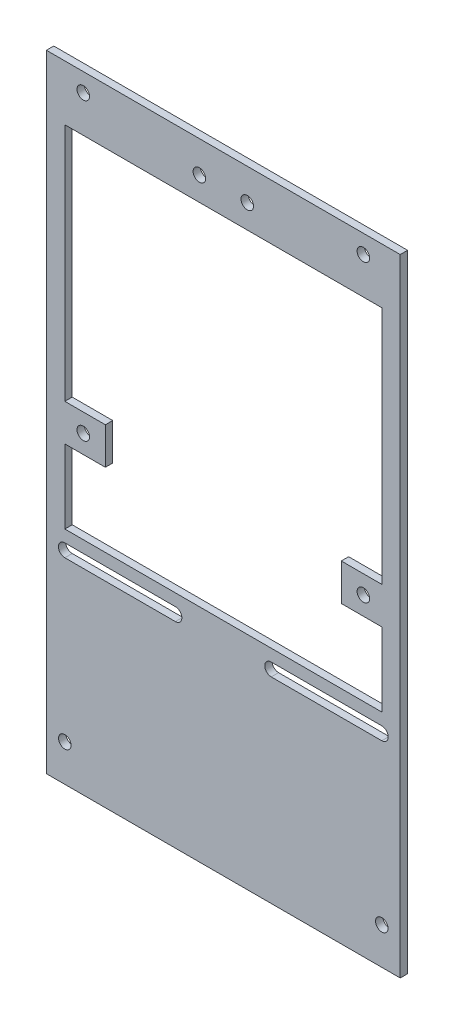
ISO-10303-21;
HEADER;
FILE_DESCRIPTION(('STEP AP214'),'2;1');
FILE_NAME('part.step','',(''),(''),'','','');
FILE_SCHEMA(('AUTOMOTIVE_DESIGN { 1 0 10303 214 1 1 1 1 }'));
ENDSEC;
DATA;
#1=APPLICATION_CONTEXT('core data for automotive mechanical design processes');
#2=APPLICATION_PROTOCOL_DEFINITION('international standard','automotive_design',2000,#1);
#3=PRODUCT_CONTEXT('',#1,'mechanical');
#4=PRODUCT('Part','Part','',(#3));
#5=PRODUCT_RELATED_PRODUCT_CATEGORY('part','',(#4));
#6=PRODUCT_DEFINITION_FORMATION('','',#4);
#7=PRODUCT_DEFINITION_CONTEXT('part definition',#1,'design');
#8=PRODUCT_DEFINITION('design','',#6,#7);
#9=PRODUCT_DEFINITION_SHAPE('','',#8);
#10=(LENGTH_UNIT() NAMED_UNIT(*) SI_UNIT(.MILLI.,.METRE.));
#11=(NAMED_UNIT(*) PLANE_ANGLE_UNIT() SI_UNIT($,.RADIAN.));
#12=(NAMED_UNIT(*) SI_UNIT($,.STERADIAN.) SOLID_ANGLE_UNIT());
#13=UNCERTAINTY_MEASURE_WITH_UNIT(LENGTH_MEASURE(1.E-05),#10,'distance_accuracy_value','');
#14=(GEOMETRIC_REPRESENTATION_CONTEXT(3) GLOBAL_UNCERTAINTY_ASSIGNED_CONTEXT((#13)) GLOBAL_UNIT_ASSIGNED_CONTEXT((#10,
#11,#12)) REPRESENTATION_CONTEXT('',''));
#15=CARTESIAN_POINT('',(0.,0.,0.));
#16=DIRECTION('',(0.,0.,1.));
#17=DIRECTION('',(1.,0.,0.));
#18=AXIS2_PLACEMENT_3D('',#15,#16,#17);
#19=CARTESIAN_POINT('',(0.,0.,2.));
#20=DIRECTION('',(0.,0.,1.));
#21=DIRECTION('',(1.,0.,0.));
#22=AXIS2_PLACEMENT_3D('',#19,#20,#21);
#23=PLANE('',#22);
#24=CARTESIAN_POINT('',(13.,-30.,2.));
#25=DIRECTION('',(0.,0.,1.));
#26=DIRECTION('',(1.,0.,0.));
#27=AXIS2_PLACEMENT_3D('',#24,#25,#26);
#28=CIRCLE('',#27,1.75);
#29=CARTESIAN_POINT('',(13.,-28.25,2.));
#30=VERTEX_POINT('',#29);
#31=CARTESIAN_POINT('',(13.,-31.75,2.));
#32=VERTEX_POINT('',#31);
#33=EDGE_CURVE('E50',#30,#32,#28,.T.);
#34=ORIENTED_EDGE('',*,*,#33,.F.);
#35=DIRECTION('',(-1.,0.,0.));
#36=VECTOR('',#35,1.);
#37=CARTESIAN_POINT('',(13.,-28.25,2.));
#38=LINE('',#37,#36);
#39=CARTESIAN_POINT('',(43.,-28.25,2.));
#40=VERTEX_POINT('',#39);
#41=EDGE_CURVE('E203',#40,#30,#38,.T.);
#42=ORIENTED_EDGE('',*,*,#41,.F.);
#43=CARTESIAN_POINT('',(43.,-30.,2.));
#44=DIRECTION('',(0.,0.,1.));
#45=DIRECTION('',(1.,0.,0.));
#46=AXIS2_PLACEMENT_3D('',#43,#44,#45);
#47=CIRCLE('',#46,1.75);
#48=CARTESIAN_POINT('',(43.,-31.75,2.));
#49=VERTEX_POINT('',#48);
#50=EDGE_CURVE('E223',#49,#40,#47,.T.);
#51=ORIENTED_EDGE('',*,*,#50,.F.);
#52=DIRECTION('',(1.,0.,0.));
#53=VECTOR('',#52,1.);
#54=CARTESIAN_POINT('',(13.,-31.75,2.));
#55=LINE('',#54,#53);
#56=EDGE_CURVE('E217',#32,#49,#55,.T.);
#57=ORIENTED_EDGE('',*,*,#56,.F.);
#58=EDGE_LOOP('',(#34,#42,#51,#57));
#59=FACE_BOUND('',#58,.T.);
#60=CARTESIAN_POINT('',(-43.,-30.,2.));
#61=DIRECTION('',(0.,0.,1.));
#62=DIRECTION('',(1.,0.,0.));
#63=AXIS2_PLACEMENT_3D('',#60,#61,#62);
#64=CIRCLE('',#63,1.75);
#65=CARTESIAN_POINT('',(-43.,-28.25,2.));
#66=VERTEX_POINT('',#65);
#67=CARTESIAN_POINT('',(-43.,-31.75,2.));
#68=VERTEX_POINT('',#67);
#69=EDGE_CURVE('E239',#66,#68,#64,.T.);
#70=ORIENTED_EDGE('',*,*,#69,.F.);
#71=DIRECTION('',(-1.,0.,0.));
#72=VECTOR('',#71,1.);
#73=CARTESIAN_POINT('',(-43.,-28.25,2.));
#74=LINE('',#73,#72);
#75=CARTESIAN_POINT('',(-13.,-28.25,2.));
#76=VERTEX_POINT('',#75);
#77=EDGE_CURVE('E247',#76,#66,#74,.T.);
#78=ORIENTED_EDGE('',*,*,#77,.F.);
#79=CARTESIAN_POINT('',(-13.,-30.,2.));
#80=DIRECTION('',(0.,0.,1.));
#81=DIRECTION('',(1.,0.,0.));
#82=AXIS2_PLACEMENT_3D('',#79,#80,#81);
#83=CIRCLE('',#82,1.75);
#84=CARTESIAN_POINT('',(-13.,-31.75,2.));
#85=VERTEX_POINT('',#84);
#86=EDGE_CURVE('E244',#85,#76,#83,.T.);
#87=ORIENTED_EDGE('',*,*,#86,.F.);
#88=DIRECTION('',(1.,0.,0.));
#89=VECTOR('',#88,1.);
#90=CARTESIAN_POINT('',(-43.,-31.75,2.));
#91=LINE('',#90,#89);
#92=EDGE_CURVE('E241',#68,#85,#91,.T.);
#93=ORIENTED_EDGE('',*,*,#92,.F.);
#94=EDGE_LOOP('',(#70,#78,#87,#93));
#95=FACE_BOUND('',#94,.T.);
#96=CARTESIAN_POINT('',(38.,80.0000000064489,2.));
#97=DIRECTION('',(0.,0.,-1.));
#98=DIRECTION('',(-1.,0.,0.));
#99=AXIS2_PLACEMENT_3D('',#96,#97,#98);
#100=CIRCLE('',#99,1.7);
#101=CARTESIAN_POINT('',(36.3,80.0000000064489,2.));
#102=VERTEX_POINT('',#101);
#103=EDGE_CURVE('E350',#102,#102,#100,.T.);
#104=ORIENTED_EDGE('',*,*,#103,.T.);
#105=EDGE_LOOP('',(#104));
#106=FACE_BOUND('',#105,.T.);
#107=CARTESIAN_POINT('',(-38.,80.0000000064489,2.));
#108=DIRECTION('',(0.,0.,-1.));
#109=DIRECTION('',(-1.,0.,0.));
#110=AXIS2_PLACEMENT_3D('',#107,#108,#109);
#111=CIRCLE('',#110,1.7);
#112=CARTESIAN_POINT('',(-39.7,80.0000000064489,2.));
#113=VERTEX_POINT('',#112);
#114=EDGE_CURVE('E356',#113,#113,#111,.T.);
#115=ORIENTED_EDGE('',*,*,#114,.T.);
#116=EDGE_LOOP('',(#115));
#117=FACE_BOUND('',#116,.T.);
#118=CARTESIAN_POINT('',(-38.,6.44892212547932E-09,2.));
#119=DIRECTION('',(0.,0.,-1.));
#120=DIRECTION('',(-1.,0.,0.));
#121=AXIS2_PLACEMENT_3D('',#118,#119,#120);
#122=CIRCLE('',#121,1.7);
#123=CARTESIAN_POINT('',(-39.7,6.44892212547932E-09,2.));
#124=VERTEX_POINT('',#123);
#125=EDGE_CURVE('E362',#124,#124,#122,.T.);
#126=ORIENTED_EDGE('',*,*,#125,.T.);
#127=EDGE_LOOP('',(#126));
#128=FACE_BOUND('',#127,.T.);
#129=CARTESIAN_POINT('',(38.,6.44892212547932E-09,2.));
#130=DIRECTION('',(0.,0.,-1.));
#131=DIRECTION('',(-1.,0.,0.));
#132=AXIS2_PLACEMENT_3D('',#129,#130,#131);
#133=CIRCLE('',#132,1.7);
#134=CARTESIAN_POINT('',(36.3,6.44892212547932E-09,2.));
#135=VERTEX_POINT('',#134);
#136=EDGE_CURVE('E368',#135,#135,#133,.T.);
#137=ORIENTED_EDGE('',*,*,#136,.T.);
#138=EDGE_LOOP('',(#137));
#139=FACE_BOUND('',#138,.T.);
#140=CARTESIAN_POINT('',(43.,-74.9999999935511,2.));
#141=DIRECTION('',(0.,0.,-1.));
#142=DIRECTION('',(-1.,0.,0.));
#143=AXIS2_PLACEMENT_3D('',#140,#141,#142);
#144=CIRCLE('',#143,1.7);
#145=CARTESIAN_POINT('',(41.3,-74.9999999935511,2.));
#146=VERTEX_POINT('',#145);
#147=EDGE_CURVE('E374',#146,#146,#144,.T.);
#148=ORIENTED_EDGE('',*,*,#147,.T.);
#149=EDGE_LOOP('',(#148));
#150=FACE_BOUND('',#149,.T.);
#151=CARTESIAN_POINT('',(-43.,-74.9999999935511,2.));
#152=DIRECTION('',(0.,0.,-1.));
#153=DIRECTION('',(-1.,0.,0.));
#154=AXIS2_PLACEMENT_3D('',#151,#152,#153);
#155=CIRCLE('',#154,1.7);
#156=CARTESIAN_POINT('',(-44.7,-74.9999999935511,2.));
#157=VERTEX_POINT('',#156);
#158=EDGE_CURVE('E380',#157,#157,#155,.T.);
#159=ORIENTED_EDGE('',*,*,#158,.T.);
#160=EDGE_LOOP('',(#159));
#161=FACE_BOUND('',#160,.T.);
#162=CARTESIAN_POINT('',(6.49999623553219,76.4436388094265,2.));
#163=DIRECTION('',(0.,0.,-1.));
#164=DIRECTION('',(-1.,0.,0.));
#165=AXIS2_PLACEMENT_3D('',#162,#163,#164);
#166=CIRCLE('',#165,1.7);
#167=CARTESIAN_POINT('',(4.7999962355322,76.4436388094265,2.));
#168=VERTEX_POINT('',#167);
#169=EDGE_CURVE('E386',#168,#168,#166,.T.);
#170=ORIENTED_EDGE('',*,*,#169,.T.);
#171=EDGE_LOOP('',(#170));
#172=FACE_BOUND('',#171,.T.);
#173=CARTESIAN_POINT('',(-6.5000037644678,76.4436388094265,2.));
#174=DIRECTION('',(0.,0.,-1.));
#175=DIRECTION('',(-1.,0.,0.));
#176=AXIS2_PLACEMENT_3D('',#173,#174,#175);
#177=CIRCLE('',#176,1.7);
#178=CARTESIAN_POINT('',(-8.2000037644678,76.4436388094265,2.));
#179=VERTEX_POINT('',#178);
#180=EDGE_CURVE('E392',#179,#179,#177,.T.);
#181=ORIENTED_EDGE('',*,*,#180,.T.);
#182=EDGE_LOOP('',(#181));
#183=FACE_BOUND('',#182,.T.);
#184=DIRECTION('',(1.,0.,0.));
#185=VECTOR('',#184,1.);
#186=CARTESIAN_POINT('',(-47.,-85.,2.));
#187=LINE('',#186,#185);
#188=CARTESIAN_POINT('',(-48.,-85.,2.));
#189=VERTEX_POINT('',#188);
#190=CARTESIAN_POINT('',(48.,-85.,2.));
#191=VERTEX_POINT('',#190);
#192=EDGE_CURVE('E398',#189,#191,#187,.T.);
#193=ORIENTED_EDGE('',*,*,#192,.T.);
#194=DIRECTION('',(0.,-1.,0.));
#195=VECTOR('',#194,1.);
#196=CARTESIAN_POINT('',(48.,85.,2.));
#197=LINE('',#196,#195);
#198=CARTESIAN_POINT('',(48.,85.,2.));
#199=VERTEX_POINT('',#198);
#200=EDGE_CURVE('E283',#199,#191,#197,.T.);
#201=ORIENTED_EDGE('',*,*,#200,.F.);
#202=DIRECTION('',(-1.,0.,0.));
#203=VECTOR('',#202,1.);
#204=CARTESIAN_POINT('',(-47.,85.,2.));
#205=LINE('',#204,#203);
#206=CARTESIAN_POINT('',(-48.,85.,2.));
#207=VERTEX_POINT('',#206);
#208=EDGE_CURVE('E396',#199,#207,#205,.T.);
#209=ORIENTED_EDGE('',*,*,#208,.T.);
#210=DIRECTION('',(0.,1.,0.));
#211=VECTOR('',#210,1.);
#212=CARTESIAN_POINT('',(-48.,-85.,2.));
#213=LINE('',#212,#211);
#214=EDGE_CURVE('E271',#189,#207,#213,.T.);
#215=ORIENTED_EDGE('',*,*,#214,.F.);
#216=EDGE_LOOP('',(#193,#201,#209,#215));
#217=FACE_BOUND('',#216,.T.);
#218=DIRECTION('',(0.,-1.,0.));
#219=VECTOR('',#218,1.);
#220=CARTESIAN_POINT('',(32.,0.,2.));
#221=LINE('',#220,#219);
#222=CARTESIAN_POINT('',(32.,5.00000000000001,2.));
#223=VERTEX_POINT('',#222);
#224=CARTESIAN_POINT('',(32.,-4.99999999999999,2.));
#225=VERTEX_POINT('',#224);
#226=EDGE_CURVE('E289',#223,#225,#221,.T.);
#227=ORIENTED_EDGE('',*,*,#226,.T.);
#228=DIRECTION('',(1.,0.,0.));
#229=VECTOR('',#228,1.);
#230=CARTESIAN_POINT('',(0.,-4.99999999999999,2.));
#231=LINE('',#230,#229);
#232=CARTESIAN_POINT('',(43.,-4.99999999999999,2.));
#233=VERTEX_POINT('',#232);
#234=EDGE_CURVE('E286',#225,#233,#231,.T.);
#235=ORIENTED_EDGE('',*,*,#234,.T.);
#236=DIRECTION('',(0.,-1.,0.));
#237=VECTOR('',#236,1.);
#238=CARTESIAN_POINT('',(43.,0.,2.));
#239=LINE('',#238,#237);
#240=CARTESIAN_POINT('',(43.,-25.,2.));
#241=VERTEX_POINT('',#240);
#242=EDGE_CURVE('E319',#233,#241,#239,.T.);
#243=ORIENTED_EDGE('',*,*,#242,.T.);
#244=DIRECTION('',(1.,0.,0.));
#245=VECTOR('',#244,1.);
#246=CARTESIAN_POINT('',(0.,-25.,2.));
#247=LINE('',#246,#245);
#248=CARTESIAN_POINT('',(-43.,-25.,2.));
#249=VERTEX_POINT('',#248);
#250=EDGE_CURVE('E316',#249,#241,#247,.T.);
#251=ORIENTED_EDGE('',*,*,#250,.F.);
#252=DIRECTION('',(0.,-1.,0.));
#253=VECTOR('',#252,1.);
#254=CARTESIAN_POINT('',(-43.,0.,2.));
#255=LINE('',#254,#253);
#256=CARTESIAN_POINT('',(-43.,-4.99999999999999,2.));
#257=VERTEX_POINT('',#256);
#258=EDGE_CURVE('E313',#257,#249,#255,.T.);
#259=ORIENTED_EDGE('',*,*,#258,.F.);
#260=DIRECTION('',(1.,0.,0.));
#261=VECTOR('',#260,1.);
#262=CARTESIAN_POINT('',(0.,-4.99999999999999,2.));
#263=LINE('',#262,#261);
#264=CARTESIAN_POINT('',(-32.,-4.99999999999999,2.));
#265=VERTEX_POINT('',#264);
#266=EDGE_CURVE('E310',#257,#265,#263,.T.);
#267=ORIENTED_EDGE('',*,*,#266,.T.);
#268=DIRECTION('',(0.,-1.,0.));
#269=VECTOR('',#268,1.);
#270=CARTESIAN_POINT('',(-32.,0.,2.));
#271=LINE('',#270,#269);
#272=CARTESIAN_POINT('',(-32.,5.00000000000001,2.));
#273=VERTEX_POINT('',#272);
#274=EDGE_CURVE('E307',#273,#265,#271,.T.);
#275=ORIENTED_EDGE('',*,*,#274,.F.);
#276=DIRECTION('',(1.,0.,0.));
#277=VECTOR('',#276,1.);
#278=CARTESIAN_POINT('',(0.,5.,2.));
#279=LINE('',#278,#277);
#280=CARTESIAN_POINT('',(-43.,5.00000000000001,2.));
#281=VERTEX_POINT('',#280);
#282=EDGE_CURVE('E304',#281,#273,#279,.T.);
#283=ORIENTED_EDGE('',*,*,#282,.F.);
#284=DIRECTION('',(0.,-1.,0.));
#285=VECTOR('',#284,1.);
#286=CARTESIAN_POINT('',(-43.,0.,2.));
#287=LINE('',#286,#285);
#288=CARTESIAN_POINT('',(-43.,70.,2.));
#289=VERTEX_POINT('',#288);
#290=EDGE_CURVE('E301',#289,#281,#287,.T.);
#291=ORIENTED_EDGE('',*,*,#290,.F.);
#292=DIRECTION('',(1.,0.,0.));
#293=VECTOR('',#292,1.);
#294=CARTESIAN_POINT('',(0.,70.,2.));
#295=LINE('',#294,#293);
#296=CARTESIAN_POINT('',(43.,70.,2.));
#297=VERTEX_POINT('',#296);
#298=EDGE_CURVE('E298',#289,#297,#295,.T.);
#299=ORIENTED_EDGE('',*,*,#298,.T.);
#300=DIRECTION('',(0.,-1.,0.));
#301=VECTOR('',#300,1.);
#302=CARTESIAN_POINT('',(43.,0.,2.));
#303=LINE('',#302,#301);
#304=CARTESIAN_POINT('',(43.,5.00000000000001,2.));
#305=VERTEX_POINT('',#304);
#306=EDGE_CURVE('E295',#297,#305,#303,.T.);
#307=ORIENTED_EDGE('',*,*,#306,.T.);
#308=DIRECTION('',(1.,0.,0.));
#309=VECTOR('',#308,1.);
#310=CARTESIAN_POINT('',(0.,5.,2.));
#311=LINE('',#310,#309);
#312=EDGE_CURVE('E292',#223,#305,#311,.T.);
#313=ORIENTED_EDGE('',*,*,#312,.F.);
#314=EDGE_LOOP('',(#227,#235,#243,#251,#259,#267,#275,#283,#291,#299,#307,#313));
#315=FACE_BOUND('',#314,.T.);
#316=ADVANCED_FACE('F35',(#59,#95,#106,#117,#128,#139,#150,#161,#172,#183,#217,#315),#23,.T.);
#317=CARTESIAN_POINT('',(0.,0.,0.));
#318=DIRECTION('',(0.,0.,1.));
#319=DIRECTION('',(1.,0.,0.));
#320=AXIS2_PLACEMENT_3D('',#317,#318,#319);
#321=PLANE('',#320);
#322=DIRECTION('',(1.,0.,0.));
#323=VECTOR('',#322,1.);
#324=CARTESIAN_POINT('',(13.,-28.25,0.));
#325=LINE('',#324,#323);
#326=CARTESIAN_POINT('',(13.,-28.25,0.));
#327=VERTEX_POINT('',#326);
#328=CARTESIAN_POINT('',(43.,-28.25,0.));
#329=VERTEX_POINT('',#328);
#330=EDGE_CURVE('E215',#327,#329,#325,.T.);
#331=ORIENTED_EDGE('',*,*,#330,.F.);
#332=CARTESIAN_POINT('',(13.,-30.,0.));
#333=DIRECTION('',(0.,0.,1.));
#334=DIRECTION('',(1.,0.,0.));
#335=AXIS2_PLACEMENT_3D('',#332,#333,#334);
#336=CIRCLE('',#335,1.75);
#337=CARTESIAN_POINT('',(13.,-31.75,0.));
#338=VERTEX_POINT('',#337);
#339=EDGE_CURVE('E197',#338,#327,#336,.F.);
#340=ORIENTED_EDGE('',*,*,#339,.F.);
#341=DIRECTION('',(-1.,0.,0.));
#342=VECTOR('',#341,1.);
#343=CARTESIAN_POINT('',(13.,-31.75,0.));
#344=LINE('',#343,#342);
#345=CARTESIAN_POINT('',(43.,-31.75,0.));
#346=VERTEX_POINT('',#345);
#347=EDGE_CURVE('E206',#346,#338,#344,.T.);
#348=ORIENTED_EDGE('',*,*,#347,.F.);
#349=CARTESIAN_POINT('',(43.,-30.,0.));
#350=DIRECTION('',(0.,0.,1.));
#351=DIRECTION('',(1.,0.,0.));
#352=AXIS2_PLACEMENT_3D('',#349,#350,#351);
#353=CIRCLE('',#352,1.75);
#354=EDGE_CURVE('E58',#329,#346,#353,.F.);
#355=ORIENTED_EDGE('',*,*,#354,.F.);
#356=EDGE_LOOP('',(#331,#340,#348,#355));
#357=FACE_BOUND('',#356,.T.);
#358=DIRECTION('',(1.,0.,0.));
#359=VECTOR('',#358,1.);
#360=CARTESIAN_POINT('',(-43.,-28.25,0.));
#361=LINE('',#360,#359);
#362=CARTESIAN_POINT('',(-43.,-28.25,0.));
#363=VERTEX_POINT('',#362);
#364=CARTESIAN_POINT('',(-13.,-28.25,0.));
#365=VERTEX_POINT('',#364);
#366=EDGE_CURVE('E233',#363,#365,#361,.T.);
#367=ORIENTED_EDGE('',*,*,#366,.F.);
#368=CARTESIAN_POINT('',(-43.,-30.,0.));
#369=DIRECTION('',(0.,0.,1.));
#370=DIRECTION('',(1.,0.,0.));
#371=AXIS2_PLACEMENT_3D('',#368,#369,#370);
#372=CIRCLE('',#371,1.75);
#373=CARTESIAN_POINT('',(-43.,-31.75,0.));
#374=VERTEX_POINT('',#373);
#375=EDGE_CURVE('E236',#374,#363,#372,.F.);
#376=ORIENTED_EDGE('',*,*,#375,.F.);
#377=DIRECTION('',(-1.,0.,0.));
#378=VECTOR('',#377,1.);
#379=CARTESIAN_POINT('',(-43.,-31.75,0.));
#380=LINE('',#379,#378);
#381=CARTESIAN_POINT('',(-13.,-31.75,0.));
#382=VERTEX_POINT('',#381);
#383=EDGE_CURVE('E253',#382,#374,#380,.T.);
#384=ORIENTED_EDGE('',*,*,#383,.F.);
#385=CARTESIAN_POINT('',(-13.,-30.,0.));
#386=DIRECTION('',(0.,0.,1.));
#387=DIRECTION('',(1.,0.,0.));
#388=AXIS2_PLACEMENT_3D('',#385,#386,#387);
#389=CIRCLE('',#388,1.75);
#390=EDGE_CURVE('E209',#365,#382,#389,.F.);
#391=ORIENTED_EDGE('',*,*,#390,.F.);
#392=EDGE_LOOP('',(#367,#376,#384,#391));
#393=FACE_BOUND('',#392,.T.);
#394=DIRECTION('',(-1.,0.,0.));
#395=VECTOR('',#394,1.);
#396=CARTESIAN_POINT('',(-47.,85.,0.));
#397=LINE('',#396,#395);
#398=CARTESIAN_POINT('',(48.,85.,0.));
#399=VERTEX_POINT('',#398);
#400=CARTESIAN_POINT('',(-48.,85.,0.));
#401=VERTEX_POINT('',#400);
#402=EDGE_CURVE('E395',#399,#401,#397,.T.);
#403=ORIENTED_EDGE('',*,*,#402,.F.);
#404=DIRECTION('',(0.,1.,0.));
#405=VECTOR('',#404,1.);
#406=CARTESIAN_POINT('',(48.,-85.,0.));
#407=LINE('',#406,#405);
#408=CARTESIAN_POINT('',(48.,-85.,0.));
#409=VERTEX_POINT('',#408);
#410=EDGE_CURVE('E277',#409,#399,#407,.T.);
#411=ORIENTED_EDGE('',*,*,#410,.F.);
#412=DIRECTION('',(1.,0.,0.));
#413=VECTOR('',#412,1.);
#414=CARTESIAN_POINT('',(-47.,-85.,0.));
#415=LINE('',#414,#413);
#416=CARTESIAN_POINT('',(-48.,-85.,0.));
#417=VERTEX_POINT('',#416);
#418=EDGE_CURVE('E399',#417,#409,#415,.T.);
#419=ORIENTED_EDGE('',*,*,#418,.F.);
#420=DIRECTION('',(0.,-1.,0.));
#421=VECTOR('',#420,1.);
#422=CARTESIAN_POINT('',(-48.,85.,0.));
#423=LINE('',#422,#421);
#424=EDGE_CURVE('E265',#401,#417,#423,.T.);
#425=ORIENTED_EDGE('',*,*,#424,.F.);
#426=EDGE_LOOP('',(#403,#411,#419,#425));
#427=FACE_BOUND('',#426,.T.);
#428=CARTESIAN_POINT('',(-6.5000037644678,76.4436388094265,0.));
#429=DIRECTION('',(0.,0.,-1.));
#430=DIRECTION('',(-1.,0.,0.));
#431=AXIS2_PLACEMENT_3D('',#428,#429,#430);
#432=CIRCLE('',#431,1.69999999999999);
#433=CARTESIAN_POINT('',(-8.20000376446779,76.4436388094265,0.));
#434=VERTEX_POINT('',#433);
#435=EDGE_CURVE('E389',#434,#434,#432,.T.);
#436=ORIENTED_EDGE('',*,*,#435,.F.);
#437=EDGE_LOOP('',(#436));
#438=FACE_BOUND('',#437,.T.);
#439=CARTESIAN_POINT('',(6.49999623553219,76.4436388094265,0.));
#440=DIRECTION('',(0.,0.,-1.));
#441=DIRECTION('',(-1.,0.,0.));
#442=AXIS2_PLACEMENT_3D('',#439,#440,#441);
#443=CIRCLE('',#442,1.69999999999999);
#444=CARTESIAN_POINT('',(4.79999623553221,76.4436388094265,0.));
#445=VERTEX_POINT('',#444);
#446=EDGE_CURVE('E383',#445,#445,#443,.T.);
#447=ORIENTED_EDGE('',*,*,#446,.F.);
#448=EDGE_LOOP('',(#447));
#449=FACE_BOUND('',#448,.T.);
#450=CARTESIAN_POINT('',(-43.,-74.9999999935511,0.));
#451=DIRECTION('',(0.,0.,-1.));
#452=DIRECTION('',(-1.,0.,0.));
#453=AXIS2_PLACEMENT_3D('',#450,#451,#452);
#454=CIRCLE('',#453,1.69999999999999);
#455=CARTESIAN_POINT('',(-44.7,-74.9999999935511,0.));
#456=VERTEX_POINT('',#455);
#457=EDGE_CURVE('E377',#456,#456,#454,.T.);
#458=ORIENTED_EDGE('',*,*,#457,.F.);
#459=EDGE_LOOP('',(#458));
#460=FACE_BOUND('',#459,.T.);
#461=CARTESIAN_POINT('',(43.,-74.9999999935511,0.));
#462=DIRECTION('',(0.,0.,-1.));
#463=DIRECTION('',(-1.,0.,0.));
#464=AXIS2_PLACEMENT_3D('',#461,#462,#463);
#465=CIRCLE('',#464,1.69999999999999);
#466=CARTESIAN_POINT('',(41.3,-74.9999999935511,0.));
#467=VERTEX_POINT('',#466);
#468=EDGE_CURVE('E371',#467,#467,#465,.T.);
#469=ORIENTED_EDGE('',*,*,#468,.F.);
#470=EDGE_LOOP('',(#469));
#471=FACE_BOUND('',#470,.T.);
#472=CARTESIAN_POINT('',(38.,6.44892212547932E-09,0.));
#473=DIRECTION('',(0.,0.,-1.));
#474=DIRECTION('',(-1.,0.,0.));
#475=AXIS2_PLACEMENT_3D('',#472,#473,#474);
#476=CIRCLE('',#475,1.69999999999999);
#477=CARTESIAN_POINT('',(36.3,6.44892212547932E-09,0.));
#478=VERTEX_POINT('',#477);
#479=EDGE_CURVE('E365',#478,#478,#476,.T.);
#480=ORIENTED_EDGE('',*,*,#479,.F.);
#481=EDGE_LOOP('',(#480));
#482=FACE_BOUND('',#481,.T.);
#483=CARTESIAN_POINT('',(-38.,6.44892212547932E-09,0.));
#484=DIRECTION('',(0.,0.,-1.));
#485=DIRECTION('',(-1.,0.,0.));
#486=AXIS2_PLACEMENT_3D('',#483,#484,#485);
#487=CIRCLE('',#486,1.69999999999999);
#488=CARTESIAN_POINT('',(-39.7,6.44892212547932E-09,0.));
#489=VERTEX_POINT('',#488);
#490=EDGE_CURVE('E359',#489,#489,#487,.T.);
#491=ORIENTED_EDGE('',*,*,#490,.F.);
#492=EDGE_LOOP('',(#491));
#493=FACE_BOUND('',#492,.T.);
#494=CARTESIAN_POINT('',(-38.,80.0000000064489,0.));
#495=DIRECTION('',(0.,0.,-1.));
#496=DIRECTION('',(-1.,0.,0.));
#497=AXIS2_PLACEMENT_3D('',#494,#495,#496);
#498=CIRCLE('',#497,1.69999999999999);
#499=CARTESIAN_POINT('',(-39.7,80.0000000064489,0.));
#500=VERTEX_POINT('',#499);
#501=EDGE_CURVE('E353',#500,#500,#498,.T.);
#502=ORIENTED_EDGE('',*,*,#501,.F.);
#503=EDGE_LOOP('',(#502));
#504=FACE_BOUND('',#503,.T.);
#505=CARTESIAN_POINT('',(38.,80.0000000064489,0.));
#506=DIRECTION('',(0.,0.,-1.));
#507=DIRECTION('',(-1.,0.,0.));
#508=AXIS2_PLACEMENT_3D('',#505,#506,#507);
#509=CIRCLE('',#508,1.69999999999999);
#510=CARTESIAN_POINT('',(36.3,80.0000000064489,0.));
#511=VERTEX_POINT('',#510);
#512=EDGE_CURVE('E325',#511,#511,#509,.T.);
#513=ORIENTED_EDGE('',*,*,#512,.F.);
#514=EDGE_LOOP('',(#513));
#515=FACE_BOUND('',#514,.T.);
#516=DIRECTION('',(1.,0.,0.));
#517=VECTOR('',#516,1.);
#518=CARTESIAN_POINT('',(0.,-4.99999999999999,0.));
#519=LINE('',#518,#517);
#520=CARTESIAN_POINT('',(32.,-4.99999999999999,0.));
#521=VERTEX_POINT('',#520);
#522=CARTESIAN_POINT('',(43.,-4.99999999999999,0.));
#523=VERTEX_POINT('',#522);
#524=EDGE_CURVE('E11',#521,#523,#519,.T.);
#525=ORIENTED_EDGE('',*,*,#524,.F.);
#526=DIRECTION('',(0.,-1.,0.));
#527=VECTOR('',#526,1.);
#528=CARTESIAN_POINT('',(32.,0.,0.));
#529=LINE('',#528,#527);
#530=CARTESIAN_POINT('',(32.,5.00000000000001,0.));
#531=VERTEX_POINT('',#530);
#532=EDGE_CURVE('E401',#531,#521,#529,.T.);
#533=ORIENTED_EDGE('',*,*,#532,.F.);
#534=DIRECTION('',(1.,0.,0.));
#535=VECTOR('',#534,1.);
#536=CARTESIAN_POINT('',(0.,5.,0.));
#537=LINE('',#536,#535);
#538=CARTESIAN_POINT('',(43.,5.00000000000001,0.));
#539=VERTEX_POINT('',#538);
#540=EDGE_CURVE('E405',#531,#539,#537,.T.);
#541=ORIENTED_EDGE('',*,*,#540,.T.);
#542=DIRECTION('',(0.,-1.,0.));
#543=VECTOR('',#542,1.);
#544=CARTESIAN_POINT('',(43.,0.,0.));
#545=LINE('',#544,#543);
#546=CARTESIAN_POINT('',(43.,70.,0.));
#547=VERTEX_POINT('',#546);
#548=EDGE_CURVE('E408',#547,#539,#545,.T.);
#549=ORIENTED_EDGE('',*,*,#548,.F.);
#550=DIRECTION('',(1.,0.,0.));
#551=VECTOR('',#550,1.);
#552=CARTESIAN_POINT('',(0.,70.,0.));
#553=LINE('',#552,#551);
#554=CARTESIAN_POINT('',(-43.,70.,0.));
#555=VERTEX_POINT('',#554);
#556=EDGE_CURVE('E410',#555,#547,#553,.T.);
#557=ORIENTED_EDGE('',*,*,#556,.F.);
#558=DIRECTION('',(0.,-1.,0.));
#559=VECTOR('',#558,1.);
#560=CARTESIAN_POINT('',(-43.,0.,0.));
#561=LINE('',#560,#559);
#562=CARTESIAN_POINT('',(-43.,5.00000000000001,0.));
#563=VERTEX_POINT('',#562);
#564=EDGE_CURVE('E412',#555,#563,#561,.T.);
#565=ORIENTED_EDGE('',*,*,#564,.T.);
#566=DIRECTION('',(1.,0.,0.));
#567=VECTOR('',#566,1.);
#568=CARTESIAN_POINT('',(0.,5.,0.));
#569=LINE('',#568,#567);
#570=CARTESIAN_POINT('',(-32.,5.00000000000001,0.));
#571=VERTEX_POINT('',#570);
#572=EDGE_CURVE('E415',#563,#571,#569,.T.);
#573=ORIENTED_EDGE('',*,*,#572,.T.);
#574=DIRECTION('',(0.,-1.,0.));
#575=VECTOR('',#574,1.);
#576=CARTESIAN_POINT('',(-32.,0.,0.));
#577=LINE('',#576,#575);
#578=CARTESIAN_POINT('',(-32.,-4.99999999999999,0.));
#579=VERTEX_POINT('',#578);
#580=EDGE_CURVE('E418',#571,#579,#577,.T.);
#581=ORIENTED_EDGE('',*,*,#580,.T.);
#582=DIRECTION('',(1.,0.,0.));
#583=VECTOR('',#582,1.);
#584=CARTESIAN_POINT('',(0.,-4.99999999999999,0.));
#585=LINE('',#584,#583);
#586=CARTESIAN_POINT('',(-43.,-4.99999999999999,0.));
#587=VERTEX_POINT('',#586);
#588=EDGE_CURVE('E421',#587,#579,#585,.T.);
#589=ORIENTED_EDGE('',*,*,#588,.F.);
#590=DIRECTION('',(0.,-1.,0.));
#591=VECTOR('',#590,1.);
#592=CARTESIAN_POINT('',(-43.,0.,0.));
#593=LINE('',#592,#591);
#594=CARTESIAN_POINT('',(-43.,-25.,0.));
#595=VERTEX_POINT('',#594);
#596=EDGE_CURVE('E423',#587,#595,#593,.T.);
#597=ORIENTED_EDGE('',*,*,#596,.T.);
#598=DIRECTION('',(1.,0.,0.));
#599=VECTOR('',#598,1.);
#600=CARTESIAN_POINT('',(0.,-25.,0.));
#601=LINE('',#600,#599);
#602=CARTESIAN_POINT('',(43.,-25.,0.));
#603=VERTEX_POINT('',#602);
#604=EDGE_CURVE('E426',#595,#603,#601,.T.);
#605=ORIENTED_EDGE('',*,*,#604,.T.);
#606=DIRECTION('',(0.,-1.,0.));
#607=VECTOR('',#606,1.);
#608=CARTESIAN_POINT('',(43.,0.,0.));
#609=LINE('',#608,#607);
#610=EDGE_CURVE('E43',#523,#603,#609,.T.);
#611=ORIENTED_EDGE('',*,*,#610,.F.);
#612=EDGE_LOOP('',(#525,#533,#541,#549,#557,#565,#573,#581,#589,#597,#605,#611));
#613=FACE_BOUND('',#612,.T.);
#614=ADVANCED_FACE('F212',(#357,#393,#427,#438,#449,#460,#471,#482,#493,#504,#515,#613),#321,.F.);
#615=CARTESIAN_POINT('',(-47.,85.,2.));
#616=DIRECTION('',(0.,-1.,0.));
#617=DIRECTION('',(0.,0.,-1.));
#618=AXIS2_PLACEMENT_3D('',#615,#616,#617);
#619=PLANE('',#618);
#620=ORIENTED_EDGE('',*,*,#402,.T.);
#621=DIRECTION('',(0.,0.,-1.));
#622=VECTOR('',#621,1.);
#623=CARTESIAN_POINT('',(-48.,85.,2.));
#624=LINE('',#623,#622);
#625=EDGE_CURVE('E262',#207,#401,#624,.T.);
#626=ORIENTED_EDGE('',*,*,#625,.F.);
#627=ORIENTED_EDGE('',*,*,#208,.F.);
#628=DIRECTION('',(0.,0.,1.));
#629=VECTOR('',#628,1.);
#630=CARTESIAN_POINT('',(48.,85.,0.));
#631=LINE('',#630,#629);
#632=EDGE_CURVE('E280',#399,#199,#631,.T.);
#633=ORIENTED_EDGE('',*,*,#632,.F.);
#634=EDGE_LOOP('',(#620,#626,#627,#633));
#635=FACE_BOUND('',#634,.T.);
#636=ADVANCED_FACE('F37',(#635),#619,.F.);
#637=CARTESIAN_POINT('',(-47.,-85.,2.));
#638=DIRECTION('',(0.,1.,0.));
#639=DIRECTION('',(0.,0.,1.));
#640=AXIS2_PLACEMENT_3D('',#637,#638,#639);
#641=PLANE('',#640);
#642=ORIENTED_EDGE('',*,*,#418,.T.);
#643=DIRECTION('',(0.,0.,-1.));
#644=VECTOR('',#643,1.);
#645=CARTESIAN_POINT('',(48.,-85.,2.));
#646=LINE('',#645,#644);
#647=EDGE_CURVE('E274',#191,#409,#646,.T.);
#648=ORIENTED_EDGE('',*,*,#647,.F.);
#649=ORIENTED_EDGE('',*,*,#192,.F.);
#650=DIRECTION('',(0.,0.,1.));
#651=VECTOR('',#650,1.);
#652=CARTESIAN_POINT('',(-48.,-85.,0.));
#653=LINE('',#652,#651);
#654=EDGE_CURVE('E268',#417,#189,#653,.T.);
#655=ORIENTED_EDGE('',*,*,#654,.F.);
#656=EDGE_LOOP('',(#642,#648,#649,#655));
#657=FACE_BOUND('',#656,.T.);
#658=ADVANCED_FACE('F502',(#657),#641,.F.);
#659=CARTESIAN_POINT('',(-6.5000037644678,76.4436388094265,0.));
#660=DIRECTION('',(0.,0.,-1.));
#661=DIRECTION('',(-1.,0.,0.));
#662=AXIS2_PLACEMENT_3D('',#659,#660,#661);
#663=CYLINDRICAL_SURFACE('',#662,1.69999999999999);
#664=ORIENTED_EDGE('',*,*,#180,.F.);
#665=EDGE_LOOP('',(#664));
#666=FACE_BOUND('',#665,.T.);
#667=ORIENTED_EDGE('',*,*,#435,.T.);
#668=EDGE_LOOP('',(#667));
#669=FACE_BOUND('',#668,.T.);
#670=ADVANCED_FACE('F500',(#666,#669),#663,.F.);
#671=CARTESIAN_POINT('',(6.49999623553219,76.4436388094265,0.));
#672=DIRECTION('',(0.,0.,-1.));
#673=DIRECTION('',(-1.,0.,0.));
#674=AXIS2_PLACEMENT_3D('',#671,#672,#673);
#675=CYLINDRICAL_SURFACE('',#674,1.69999999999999);
#676=ORIENTED_EDGE('',*,*,#169,.F.);
#677=EDGE_LOOP('',(#676));
#678=FACE_BOUND('',#677,.T.);
#679=ORIENTED_EDGE('',*,*,#446,.T.);
#680=EDGE_LOOP('',(#679));
#681=FACE_BOUND('',#680,.T.);
#682=ADVANCED_FACE('F509',(#678,#681),#675,.F.);
#683=CARTESIAN_POINT('',(-43.,-74.9999999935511,0.));
#684=DIRECTION('',(0.,0.,-1.));
#685=DIRECTION('',(-1.,0.,0.));
#686=AXIS2_PLACEMENT_3D('',#683,#684,#685);
#687=CYLINDRICAL_SURFACE('',#686,1.69999999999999);
#688=ORIENTED_EDGE('',*,*,#158,.F.);
#689=EDGE_LOOP('',(#688));
#690=FACE_BOUND('',#689,.T.);
#691=ORIENTED_EDGE('',*,*,#457,.T.);
#692=EDGE_LOOP('',(#691));
#693=FACE_BOUND('',#692,.T.);
#694=ADVANCED_FACE('F779',(#690,#693),#687,.F.);
#695=CARTESIAN_POINT('',(43.,-74.9999999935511,0.));
#696=DIRECTION('',(0.,0.,-1.));
#697=DIRECTION('',(-1.,0.,0.));
#698=AXIS2_PLACEMENT_3D('',#695,#696,#697);
#699=CYLINDRICAL_SURFACE('',#698,1.69999999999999);
#700=ORIENTED_EDGE('',*,*,#147,.F.);
#701=EDGE_LOOP('',(#700));
#702=FACE_BOUND('',#701,.T.);
#703=ORIENTED_EDGE('',*,*,#468,.T.);
#704=EDGE_LOOP('',(#703));
#705=FACE_BOUND('',#704,.T.);
#706=ADVANCED_FACE('F775',(#702,#705),#699,.F.);
#707=CARTESIAN_POINT('',(38.,6.44892212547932E-09,0.));
#708=DIRECTION('',(0.,0.,-1.));
#709=DIRECTION('',(-1.,0.,0.));
#710=AXIS2_PLACEMENT_3D('',#707,#708,#709);
#711=CYLINDRICAL_SURFACE('',#710,1.69999999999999);
#712=ORIENTED_EDGE('',*,*,#136,.F.);
#713=EDGE_LOOP('',(#712));
#714=FACE_BOUND('',#713,.T.);
#715=ORIENTED_EDGE('',*,*,#479,.T.);
#716=EDGE_LOOP('',(#715));
#717=FACE_BOUND('',#716,.T.);
#718=ADVANCED_FACE('F771',(#714,#717),#711,.F.);
#719=CARTESIAN_POINT('',(-38.,6.44892212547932E-09,0.));
#720=DIRECTION('',(0.,0.,-1.));
#721=DIRECTION('',(-1.,0.,0.));
#722=AXIS2_PLACEMENT_3D('',#719,#720,#721);
#723=CYLINDRICAL_SURFACE('',#722,1.69999999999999);
#724=ORIENTED_EDGE('',*,*,#125,.F.);
#725=EDGE_LOOP('',(#724));
#726=FACE_BOUND('',#725,.T.);
#727=ORIENTED_EDGE('',*,*,#490,.T.);
#728=EDGE_LOOP('',(#727));
#729=FACE_BOUND('',#728,.T.);
#730=ADVANCED_FACE('F765',(#726,#729),#723,.F.);
#731=CARTESIAN_POINT('',(-38.,80.0000000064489,0.));
#732=DIRECTION('',(0.,0.,-1.));
#733=DIRECTION('',(-1.,0.,0.));
#734=AXIS2_PLACEMENT_3D('',#731,#732,#733);
#735=CYLINDRICAL_SURFACE('',#734,1.69999999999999);
#736=ORIENTED_EDGE('',*,*,#114,.F.);
#737=EDGE_LOOP('',(#736));
#738=FACE_BOUND('',#737,.T.);
#739=ORIENTED_EDGE('',*,*,#501,.T.);
#740=EDGE_LOOP('',(#739));
#741=FACE_BOUND('',#740,.T.);
#742=ADVANCED_FACE('F757',(#738,#741),#735,.F.);
#743=CARTESIAN_POINT('',(38.,80.0000000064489,0.));
#744=DIRECTION('',(0.,0.,-1.));
#745=DIRECTION('',(-1.,0.,0.));
#746=AXIS2_PLACEMENT_3D('',#743,#744,#745);
#747=CYLINDRICAL_SURFACE('',#746,1.69999999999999);
#748=ORIENTED_EDGE('',*,*,#103,.F.);
#749=EDGE_LOOP('',(#748));
#750=FACE_BOUND('',#749,.T.);
#751=ORIENTED_EDGE('',*,*,#512,.T.);
#752=EDGE_LOOP('',(#751));
#753=FACE_BOUND('',#752,.T.);
#754=ADVANCED_FACE('F755',(#750,#753),#747,.F.);
#755=CARTESIAN_POINT('',(0.,-4.99999999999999,-8.));
#756=DIRECTION('',(0.,-1.,0.));
#757=DIRECTION('',(0.,0.,-1.));
#758=AXIS2_PLACEMENT_3D('',#755,#756,#757);
#759=PLANE('',#758);
#760=ORIENTED_EDGE('',*,*,#524,.T.);
#761=DIRECTION('',(0.,0.,1.));
#762=VECTOR('',#761,1.);
#763=CARTESIAN_POINT('',(43.,-4.99999999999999,-8.));
#764=LINE('',#763,#762);
#765=EDGE_CURVE('E323',#523,#233,#764,.T.);
#766=ORIENTED_EDGE('',*,*,#765,.T.);
#767=ORIENTED_EDGE('',*,*,#234,.F.);
#768=DIRECTION('',(0.,0.,1.));
#769=VECTOR('',#768,1.);
#770=CARTESIAN_POINT('',(32.,-4.99999999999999,-8.));
#771=LINE('',#770,#769);
#772=EDGE_CURVE('E322',#521,#225,#771,.T.);
#773=ORIENTED_EDGE('',*,*,#772,.F.);
#774=EDGE_LOOP('',(#760,#766,#767,#773));
#775=FACE_BOUND('',#774,.T.);
#776=ADVANCED_FACE('F455',(#775),#759,.T.);
#777=CARTESIAN_POINT('',(43.,0.,-8.));
#778=DIRECTION('',(-1.,0.,0.));
#779=DIRECTION('',(0.,-1.,0.));
#780=AXIS2_PLACEMENT_3D('',#777,#778,#779);
#781=PLANE('',#780);
#782=ORIENTED_EDGE('',*,*,#610,.T.);
#783=DIRECTION('',(0.,0.,1.));
#784=VECTOR('',#783,1.);
#785=CARTESIAN_POINT('',(43.,-25.,-8.));
#786=LINE('',#785,#784);
#787=EDGE_CURVE('E326',#603,#241,#786,.T.);
#788=ORIENTED_EDGE('',*,*,#787,.T.);
#789=ORIENTED_EDGE('',*,*,#242,.F.);
#790=ORIENTED_EDGE('',*,*,#765,.F.);
#791=EDGE_LOOP('',(#782,#788,#789,#790));
#792=FACE_BOUND('',#791,.T.);
#793=ADVANCED_FACE('F432',(#792),#781,.T.);
#794=CARTESIAN_POINT('',(0.,-25.,-8.));
#795=DIRECTION('',(0.,-1.,0.));
#796=DIRECTION('',(0.,0.,-1.));
#797=AXIS2_PLACEMENT_3D('',#794,#795,#796);
#798=PLANE('',#797);
#799=DIRECTION('',(0.,0.,1.));
#800=VECTOR('',#799,1.);
#801=CARTESIAN_POINT('',(-43.,-25.,-8.));
#802=LINE('',#801,#800);
#803=EDGE_CURVE('E328',#595,#249,#802,.T.);
#804=ORIENTED_EDGE('',*,*,#803,.T.);
#805=ORIENTED_EDGE('',*,*,#250,.T.);
#806=ORIENTED_EDGE('',*,*,#787,.F.);
#807=ORIENTED_EDGE('',*,*,#604,.F.);
#808=EDGE_LOOP('',(#804,#805,#806,#807));
#809=FACE_BOUND('',#808,.T.);
#810=ADVANCED_FACE('F437',(#809),#798,.F.);
#811=CARTESIAN_POINT('',(-43.,0.,-8.));
#812=DIRECTION('',(-1.,0.,0.));
#813=DIRECTION('',(0.,0.,1.));
#814=AXIS2_PLACEMENT_3D('',#811,#812,#813);
#815=PLANE('',#814);
#816=DIRECTION('',(0.,0.,1.));
#817=VECTOR('',#816,1.);
#818=CARTESIAN_POINT('',(-43.,-4.99999999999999,-8.));
#819=LINE('',#818,#817);
#820=EDGE_CURVE('E330',#587,#257,#819,.T.);
#821=ORIENTED_EDGE('',*,*,#820,.T.);
#822=ORIENTED_EDGE('',*,*,#258,.T.);
#823=ORIENTED_EDGE('',*,*,#803,.F.);
#824=ORIENTED_EDGE('',*,*,#596,.F.);
#825=EDGE_LOOP('',(#821,#822,#823,#824));
#826=FACE_BOUND('',#825,.T.);
#827=ADVANCED_FACE('F443',(#826),#815,.F.);
#828=CARTESIAN_POINT('',(0.,-4.99999999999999,-8.));
#829=DIRECTION('',(0.,-1.,0.));
#830=DIRECTION('',(0.,0.,-1.));
#831=AXIS2_PLACEMENT_3D('',#828,#829,#830);
#832=PLANE('',#831);
#833=ORIENTED_EDGE('',*,*,#588,.T.);
#834=DIRECTION('',(0.,0.,1.));
#835=VECTOR('',#834,1.);
#836=CARTESIAN_POINT('',(-32.,-4.99999999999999,-8.));
#837=LINE('',#836,#835);
#838=EDGE_CURVE('E332',#579,#265,#837,.T.);
#839=ORIENTED_EDGE('',*,*,#838,.T.);
#840=ORIENTED_EDGE('',*,*,#266,.F.);
#841=ORIENTED_EDGE('',*,*,#820,.F.);
#842=EDGE_LOOP('',(#833,#839,#840,#841));
#843=FACE_BOUND('',#842,.T.);
#844=ADVANCED_FACE('F446',(#843),#832,.T.);
#845=CARTESIAN_POINT('',(-32.,0.,-8.));
#846=DIRECTION('',(-1.,0.,0.));
#847=DIRECTION('',(0.,0.,1.));
#848=AXIS2_PLACEMENT_3D('',#845,#846,#847);
#849=PLANE('',#848);
#850=DIRECTION('',(0.,0.,1.));
#851=VECTOR('',#850,1.);
#852=CARTESIAN_POINT('',(-32.,5.00000000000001,-8.));
#853=LINE('',#852,#851);
#854=EDGE_CURVE('E334',#571,#273,#853,.T.);
#855=ORIENTED_EDGE('',*,*,#854,.T.);
#856=ORIENTED_EDGE('',*,*,#274,.T.);
#857=ORIENTED_EDGE('',*,*,#838,.F.);
#858=ORIENTED_EDGE('',*,*,#580,.F.);
#859=EDGE_LOOP('',(#855,#856,#857,#858));
#860=FACE_BOUND('',#859,.T.);
#861=ADVANCED_FACE('F482',(#860),#849,.F.);
#862=CARTESIAN_POINT('',(0.,5.,-8.));
#863=DIRECTION('',(0.,-1.,0.));
#864=DIRECTION('',(1.,0.,0.));
#865=AXIS2_PLACEMENT_3D('',#862,#863,#864);
#866=PLANE('',#865);
#867=DIRECTION('',(0.,0.,1.));
#868=VECTOR('',#867,1.);
#869=CARTESIAN_POINT('',(-43.,5.00000000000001,-8.));
#870=LINE('',#869,#868);
#871=EDGE_CURVE('E336',#563,#281,#870,.T.);
#872=ORIENTED_EDGE('',*,*,#871,.T.);
#873=ORIENTED_EDGE('',*,*,#282,.T.);
#874=ORIENTED_EDGE('',*,*,#854,.F.);
#875=ORIENTED_EDGE('',*,*,#572,.F.);
#876=EDGE_LOOP('',(#872,#873,#874,#875));
#877=FACE_BOUND('',#876,.T.);
#878=ADVANCED_FACE('F479',(#877),#866,.F.);
#879=CARTESIAN_POINT('',(-43.,0.,-8.));
#880=DIRECTION('',(-1.,0.,0.));
#881=DIRECTION('',(0.,-1.,0.));
#882=AXIS2_PLACEMENT_3D('',#879,#880,#881);
#883=PLANE('',#882);
#884=DIRECTION('',(0.,0.,1.));
#885=VECTOR('',#884,1.);
#886=CARTESIAN_POINT('',(-43.,70.,-8.));
#887=LINE('',#886,#885);
#888=EDGE_CURVE('E338',#555,#289,#887,.T.);
#889=ORIENTED_EDGE('',*,*,#888,.T.);
#890=ORIENTED_EDGE('',*,*,#290,.T.);
#891=ORIENTED_EDGE('',*,*,#871,.F.);
#892=ORIENTED_EDGE('',*,*,#564,.F.);
#893=EDGE_LOOP('',(#889,#890,#891,#892));
#894=FACE_BOUND('',#893,.T.);
#895=ADVANCED_FACE('F476',(#894),#883,.F.);
#896=CARTESIAN_POINT('',(0.,70.,-8.));
#897=DIRECTION('',(0.,-1.,0.));
#898=DIRECTION('',(0.,0.,-1.));
#899=AXIS2_PLACEMENT_3D('',#896,#897,#898);
#900=PLANE('',#899);
#901=ORIENTED_EDGE('',*,*,#556,.T.);
#902=DIRECTION('',(0.,0.,1.));
#903=VECTOR('',#902,1.);
#904=CARTESIAN_POINT('',(43.,70.,-8.));
#905=LINE('',#904,#903);
#906=EDGE_CURVE('E340',#547,#297,#905,.T.);
#907=ORIENTED_EDGE('',*,*,#906,.T.);
#908=ORIENTED_EDGE('',*,*,#298,.F.);
#909=ORIENTED_EDGE('',*,*,#888,.F.);
#910=EDGE_LOOP('',(#901,#907,#908,#909));
#911=FACE_BOUND('',#910,.T.);
#912=ADVANCED_FACE('F471',(#911),#900,.T.);
#913=CARTESIAN_POINT('',(43.,0.,-8.));
#914=DIRECTION('',(-1.,0.,0.));
#915=DIRECTION('',(0.,-1.,0.));
#916=AXIS2_PLACEMENT_3D('',#913,#914,#915);
#917=PLANE('',#916);
#918=ORIENTED_EDGE('',*,*,#548,.T.);
#919=DIRECTION('',(0.,0.,1.));
#920=VECTOR('',#919,1.);
#921=CARTESIAN_POINT('',(43.,5.00000000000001,-8.));
#922=LINE('',#921,#920);
#923=EDGE_CURVE('E342',#539,#305,#922,.T.);
#924=ORIENTED_EDGE('',*,*,#923,.T.);
#925=ORIENTED_EDGE('',*,*,#306,.F.);
#926=ORIENTED_EDGE('',*,*,#906,.F.);
#927=EDGE_LOOP('',(#918,#924,#925,#926));
#928=FACE_BOUND('',#927,.T.);
#929=ADVANCED_FACE('F467',(#928),#917,.T.);
#930=CARTESIAN_POINT('',(0.,5.,-8.));
#931=DIRECTION('',(0.,-1.,0.));
#932=DIRECTION('',(1.,0.,0.));
#933=AXIS2_PLACEMENT_3D('',#930,#931,#932);
#934=PLANE('',#933);
#935=DIRECTION('',(0.,0.,1.));
#936=VECTOR('',#935,1.);
#937=CARTESIAN_POINT('',(32.,5.00000000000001,-8.));
#938=LINE('',#937,#936);
#939=EDGE_CURVE('E344',#531,#223,#938,.T.);
#940=ORIENTED_EDGE('',*,*,#939,.T.);
#941=ORIENTED_EDGE('',*,*,#312,.T.);
#942=ORIENTED_EDGE('',*,*,#923,.F.);
#943=ORIENTED_EDGE('',*,*,#540,.F.);
#944=EDGE_LOOP('',(#940,#941,#942,#943));
#945=FACE_BOUND('',#944,.T.);
#946=ADVANCED_FACE('F464',(#945),#934,.F.);
#947=CARTESIAN_POINT('',(32.,0.,-8.));
#948=DIRECTION('',(-1.,0.,0.));
#949=DIRECTION('',(0.,0.,1.));
#950=AXIS2_PLACEMENT_3D('',#947,#948,#949);
#951=PLANE('',#950);
#952=ORIENTED_EDGE('',*,*,#532,.T.);
#953=ORIENTED_EDGE('',*,*,#772,.T.);
#954=ORIENTED_EDGE('',*,*,#226,.F.);
#955=ORIENTED_EDGE('',*,*,#939,.F.);
#956=EDGE_LOOP('',(#952,#953,#954,#955));
#957=FACE_BOUND('',#956,.T.);
#958=ADVANCED_FACE('F457',(#957),#951,.T.);
#959=CARTESIAN_POINT('',(48.,0.,0.));
#960=DIRECTION('',(1.,0.,0.));
#961=DIRECTION('',(0.,1.,0.));
#962=AXIS2_PLACEMENT_3D('',#959,#960,#961);
#963=PLANE('',#962);
#964=ORIENTED_EDGE('',*,*,#647,.T.);
#965=ORIENTED_EDGE('',*,*,#410,.T.);
#966=ORIENTED_EDGE('',*,*,#632,.T.);
#967=ORIENTED_EDGE('',*,*,#200,.T.);
#968=EDGE_LOOP('',(#964,#965,#966,#967));
#969=FACE_BOUND('',#968,.T.);
#970=ADVANCED_FACE('F520',(#969),#963,.T.);
#971=CARTESIAN_POINT('',(-48.,0.,0.));
#972=DIRECTION('',(-1.,0.,0.));
#973=DIRECTION('',(0.,-1.,0.));
#974=AXIS2_PLACEMENT_3D('',#971,#972,#973);
#975=PLANE('',#974);
#976=ORIENTED_EDGE('',*,*,#625,.T.);
#977=ORIENTED_EDGE('',*,*,#424,.T.);
#978=ORIENTED_EDGE('',*,*,#654,.T.);
#979=ORIENTED_EDGE('',*,*,#214,.T.);
#980=EDGE_LOOP('',(#976,#977,#978,#979));
#981=FACE_BOUND('',#980,.T.);
#982=ADVANCED_FACE('F525',(#981),#975,.T.);
#983=CARTESIAN_POINT('',(-43.,-30.,-0.00100000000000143));
#984=DIRECTION('',(0.,0.,1.));
#985=DIRECTION('',(1.,0.,0.));
#986=AXIS2_PLACEMENT_3D('',#983,#984,#985);
#987=CYLINDRICAL_SURFACE('',#986,1.75);
#988=ORIENTED_EDGE('',*,*,#375,.T.);
#989=DIRECTION('',(0.,0.,1.));
#990=VECTOR('',#989,1.);
#991=CARTESIAN_POINT('',(-43.,-28.25,-0.00100000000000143));
#992=LINE('',#991,#990);
#993=EDGE_CURVE('E251',#363,#66,#992,.T.);
#994=ORIENTED_EDGE('',*,*,#993,.T.);
#995=ORIENTED_EDGE('',*,*,#69,.T.);
#996=DIRECTION('',(0.,0.,1.));
#997=VECTOR('',#996,1.);
#998=CARTESIAN_POINT('',(-43.,-31.75,-0.00100000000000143));
#999=LINE('',#998,#997);
#1000=EDGE_CURVE('E250',#374,#68,#999,.T.);
#1001=ORIENTED_EDGE('',*,*,#1000,.F.);
#1002=EDGE_LOOP('',(#988,#994,#995,#1001));
#1003=FACE_BOUND('',#1002,.T.);
#1004=ADVANCED_FACE('F528',(#1003),#987,.F.);
#1005=CARTESIAN_POINT('',(-43.,-28.25,-0.00100000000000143));
#1006=DIRECTION('',(0.,1.,0.));
#1007=DIRECTION('',(0.,0.,1.));
#1008=AXIS2_PLACEMENT_3D('',#1005,#1006,#1007);
#1009=PLANE('',#1008);
#1010=ORIENTED_EDGE('',*,*,#366,.T.);
#1011=DIRECTION('',(0.,0.,1.));
#1012=VECTOR('',#1011,1.);
#1013=CARTESIAN_POINT('',(-13.,-28.25,-0.00100000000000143));
#1014=LINE('',#1013,#1012);
#1015=EDGE_CURVE('E254',#365,#76,#1014,.T.);
#1016=ORIENTED_EDGE('',*,*,#1015,.T.);
#1017=ORIENTED_EDGE('',*,*,#77,.T.);
#1018=ORIENTED_EDGE('',*,*,#993,.F.);
#1019=EDGE_LOOP('',(#1010,#1016,#1017,#1018));
#1020=FACE_BOUND('',#1019,.T.);
#1021=ADVANCED_FACE('F534',(#1020),#1009,.F.);
#1022=CARTESIAN_POINT('',(-13.,-30.,-0.00100000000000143));
#1023=DIRECTION('',(0.,0.,1.));
#1024=DIRECTION('',(1.,0.,0.));
#1025=AXIS2_PLACEMENT_3D('',#1022,#1023,#1024);
#1026=CYLINDRICAL_SURFACE('',#1025,1.75);
#1027=ORIENTED_EDGE('',*,*,#390,.T.);
#1028=DIRECTION('',(0.,0.,1.));
#1029=VECTOR('',#1028,1.);
#1030=CARTESIAN_POINT('',(-13.,-31.75,-0.00100000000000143));
#1031=LINE('',#1030,#1029);
#1032=EDGE_CURVE('E256',#382,#85,#1031,.T.);
#1033=ORIENTED_EDGE('',*,*,#1032,.T.);
#1034=ORIENTED_EDGE('',*,*,#86,.T.);
#1035=ORIENTED_EDGE('',*,*,#1015,.F.);
#1036=EDGE_LOOP('',(#1027,#1033,#1034,#1035));
#1037=FACE_BOUND('',#1036,.T.);
#1038=ADVANCED_FACE('F653',(#1037),#1026,.F.);
#1039=CARTESIAN_POINT('',(-43.,-31.75,-0.00100000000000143));
#1040=DIRECTION('',(0.,-1.,0.));
#1041=DIRECTION('',(0.,0.,-1.));
#1042=AXIS2_PLACEMENT_3D('',#1039,#1040,#1041);
#1043=PLANE('',#1042);
#1044=ORIENTED_EDGE('',*,*,#383,.T.);
#1045=ORIENTED_EDGE('',*,*,#1000,.T.);
#1046=ORIENTED_EDGE('',*,*,#92,.T.);
#1047=ORIENTED_EDGE('',*,*,#1032,.F.);
#1048=EDGE_LOOP('',(#1044,#1045,#1046,#1047));
#1049=FACE_BOUND('',#1048,.T.);
#1050=ADVANCED_FACE('F663',(#1049),#1043,.F.);
#1051=CARTESIAN_POINT('',(13.,-30.,-0.00100000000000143));
#1052=DIRECTION('',(0.,0.,1.));
#1053=DIRECTION('',(1.,0.,0.));
#1054=AXIS2_PLACEMENT_3D('',#1051,#1052,#1053);
#1055=CYLINDRICAL_SURFACE('',#1054,1.75);
#1056=ORIENTED_EDGE('',*,*,#339,.T.);
#1057=DIRECTION('',(0.,0.,1.));
#1058=VECTOR('',#1057,1.);
#1059=CARTESIAN_POINT('',(13.,-28.25,-0.00100000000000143));
#1060=LINE('',#1059,#1058);
#1061=EDGE_CURVE('E210',#327,#30,#1060,.T.);
#1062=ORIENTED_EDGE('',*,*,#1061,.T.);
#1063=ORIENTED_EDGE('',*,*,#33,.T.);
#1064=DIRECTION('',(0.,0.,1.));
#1065=VECTOR('',#1064,1.);
#1066=CARTESIAN_POINT('',(13.,-31.75,-0.00100000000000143));
#1067=LINE('',#1066,#1065);
#1068=EDGE_CURVE('E193',#338,#32,#1067,.T.);
#1069=ORIENTED_EDGE('',*,*,#1068,.F.);
#1070=EDGE_LOOP('',(#1056,#1062,#1063,#1069));
#1071=FACE_BOUND('',#1070,.T.);
#1072=ADVANCED_FACE('F195',(#1071),#1055,.F.);
#1073=CARTESIAN_POINT('',(13.,-28.25,-0.00100000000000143));
#1074=DIRECTION('',(0.,1.,0.));
#1075=DIRECTION('',(0.,0.,1.));
#1076=AXIS2_PLACEMENT_3D('',#1073,#1074,#1075);
#1077=PLANE('',#1076);
#1078=ORIENTED_EDGE('',*,*,#330,.T.);
#1079=DIRECTION('',(0.,0.,1.));
#1080=VECTOR('',#1079,1.);
#1081=CARTESIAN_POINT('',(43.,-28.25,-0.00100000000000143));
#1082=LINE('',#1081,#1080);
#1083=EDGE_CURVE('E229',#329,#40,#1082,.T.);
#1084=ORIENTED_EDGE('',*,*,#1083,.T.);
#1085=ORIENTED_EDGE('',*,*,#41,.T.);
#1086=ORIENTED_EDGE('',*,*,#1061,.F.);
#1087=EDGE_LOOP('',(#1078,#1084,#1085,#1086));
#1088=FACE_BOUND('',#1087,.T.);
#1089=ADVANCED_FACE('F681',(#1088),#1077,.F.);
#1090=CARTESIAN_POINT('',(43.,-30.,-0.00100000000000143));
#1091=DIRECTION('',(0.,0.,1.));
#1092=DIRECTION('',(1.,0.,0.));
#1093=AXIS2_PLACEMENT_3D('',#1090,#1091,#1092);
#1094=CYLINDRICAL_SURFACE('',#1093,1.75);
#1095=ORIENTED_EDGE('',*,*,#354,.T.);
#1096=DIRECTION('',(0.,0.,1.));
#1097=VECTOR('',#1096,1.);
#1098=CARTESIAN_POINT('',(43.,-31.75,-0.00100000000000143));
#1099=LINE('',#1098,#1097);
#1100=EDGE_CURVE('E202',#346,#49,#1099,.T.);
#1101=ORIENTED_EDGE('',*,*,#1100,.T.);
#1102=ORIENTED_EDGE('',*,*,#50,.T.);
#1103=ORIENTED_EDGE('',*,*,#1083,.F.);
#1104=EDGE_LOOP('',(#1095,#1101,#1102,#1103));
#1105=FACE_BOUND('',#1104,.T.);
#1106=ADVANCED_FACE('F690',(#1105),#1094,.F.);
#1107=CARTESIAN_POINT('',(13.,-31.75,-0.00100000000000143));
#1108=DIRECTION('',(0.,-1.,0.));
#1109=DIRECTION('',(0.,0.,-1.));
#1110=AXIS2_PLACEMENT_3D('',#1107,#1108,#1109);
#1111=PLANE('',#1110);
#1112=ORIENTED_EDGE('',*,*,#347,.T.);
#1113=ORIENTED_EDGE('',*,*,#1068,.T.);
#1114=ORIENTED_EDGE('',*,*,#56,.T.);
#1115=ORIENTED_EDGE('',*,*,#1100,.F.);
#1116=EDGE_LOOP('',(#1112,#1113,#1114,#1115));
#1117=FACE_BOUND('',#1116,.T.);
#1118=ADVANCED_FACE('F207',(#1117),#1111,.F.);
#1119=CLOSED_SHELL('',(#316,#614,#636,#658,#670,#682,#694,#706,#718,#730,#742,#754,#776,#793,
#810,#827,#844,#861,#878,#895,#912,#929,#946,#958,#970,#982,#1004,#1021,#1038,#1050,#1072,#1089,
#1106,#1118));
#1120=MANIFOLD_SOLID_BREP('B2',#1119);
#1121=ADVANCED_BREP_SHAPE_REPRESENTATION('',(#18,#1120),#14);
#1122=SHAPE_DEFINITION_REPRESENTATION(#9,#1121);
ENDSEC;
END-ISO-10303-21;
